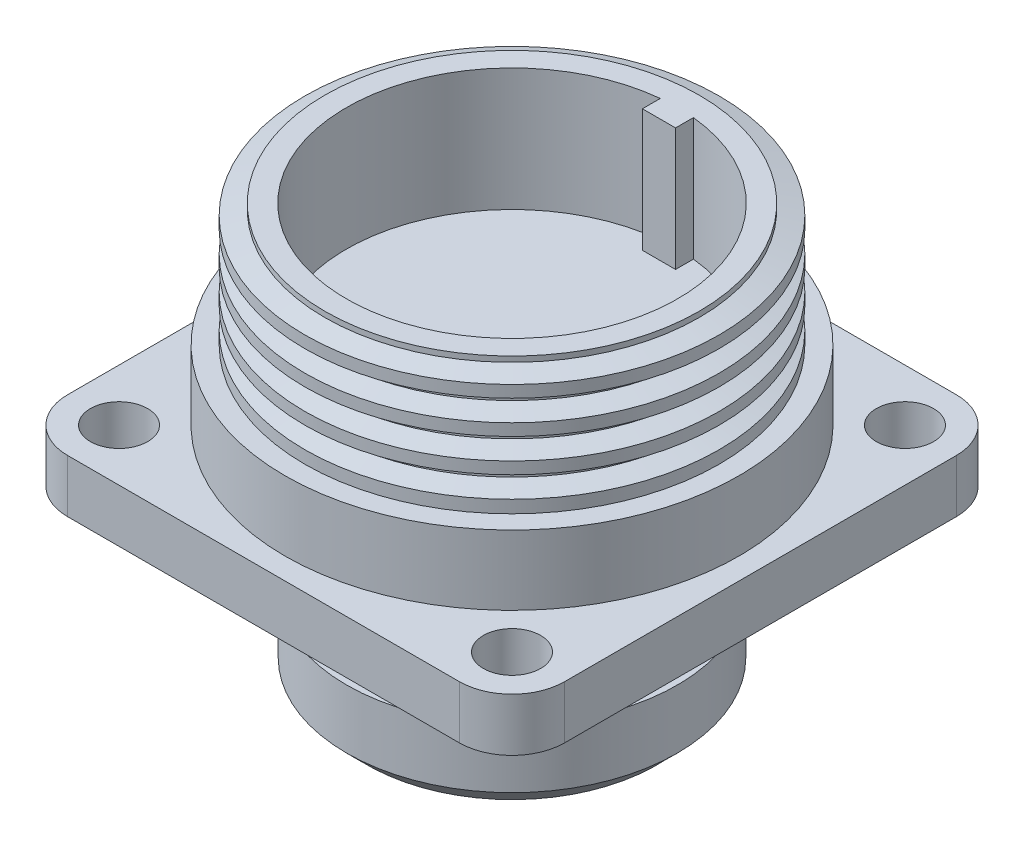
from build123d import *

# Parameters (mm, degrees)
SKETCH1_W           = 38.1
SKETCH1_H           = 38.1
SKETCH1_R           = 2.1971
BASE_EXTRUDE_DEPTH  = 4.064
SKETCH2_R           = 17.399
BOSS_EXTRUDE1_DEPTH = 5.334
SKETCH9_R           = 15.875
EXTRUDE1_DEPTH      = 9.398
SKETCH3_R           = 12.6746
PLUG_DEPTH          = 12.954
CHAMFER1_SIZE       = 1.5748
CUT_EXTRUDE1_DEPTH  = 9.398
FILLET1_R           = 4.0386
SKETCH7_W           = 1.2446
SKETCH7_H           = 2.3622
SKETCH8_W           = 2.5654
SKETCH8_H           = 1.27


with BuildPart() as part:
    # Sketch1 → Base-Extrude (new body)
    with BuildSketch(Plane(origin=(0, 0, 0), x_dir=(1, 0, 0), z_dir=(0, 1, 0))):
        Rectangle(SKETCH1_W, SKETCH1_H)
        with Locations(Location((-15.0622, 15.0622, 0), (0, 0, 270))):
            Circle(SKETCH1_R, mode=Mode.SUBTRACT)
        with Locations(Location((15.0622, 15.0622, 0), (0, 0, 90))):
            Circle(SKETCH1_R, mode=Mode.SUBTRACT)
        with Locations(Location((15.0622, -15.0622, 0), (0, 0, 270))):
            Circle(SKETCH1_R, mode=Mode.SUBTRACT)
        with Locations(Location((-15.0622, -15.0622, 0), (0, 0, 90))):
            Circle(SKETCH1_R, mode=Mode.SUBTRACT)
    extrude(amount=BASE_EXTRUDE_DEPTH)

    # Sketch2 → Boss-Extrude1 (add)
    with BuildSketch(Plane(origin=(0, 4.064, 0), x_dir=(-1, 0, 0), z_dir=(0, 1, 0))):
        with Locations(Location((0, 0, 0), (0, 0, 90))):
            Circle(SKETCH2_R)
    extrude(amount=BOSS_EXTRUDE1_DEPTH)

    # Sketch9 → Extrude1 (add)
    with BuildSketch(Plane(origin=(0, 9.398, 0), x_dir=(1, 0, 0), z_dir=(0, 1, 0))):
        with Locations(Location((0, 0, 0), (0, 0, 270))):
            Circle(SKETCH9_R)
    extrude(amount=EXTRUDE1_DEPTH)

    # Sketch3 → Plug (add)
    with BuildSketch(Plane.XZ):
        with Locations(Location((0, 0, 0), (0, 0, 90))):
            Circle(SKETCH3_R)
    extrude(amount=PLUG_DEPTH)

    # Chamfer1
    chamfer1_edges = [part.edges().sort_by_distance(p)[0] for p in [
        (0, -12.954, -12.6746),
    ]]
    chamfer(chamfer1_edges, length=CHAMFER1_SIZE)

    # Sketch10 → Cut-Extrude1 (cut)
    with BuildSketch(Plane(origin=(0, 18.796, 0), x_dir=(1, 0, 0), z_dir=(0, 1, 0))):
        with BuildLine():
            Line((-1.27, 12.636340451), (-1.27, 11.267947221))
            Line((-1.27, 11.267947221), (1.27, 11.267947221))
            Line((1.27, 11.267947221), (1.27, 12.636340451))
            ThreePointArc((1.27, 12.636340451), (0, -12.7), (-1.27, 12.636340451))
        make_face()
    extrude(amount=-CUT_EXTRUDE1_DEPTH, mode=Mode.SUBTRACT)

    # Fillet1
    fillet1_edges = [part.edges().sort_by_distance(p)[0] for p in [
        (-19.05, 2.032, -19.05),
        (19.05, 2.032, -19.05),
        (19.05, 2.032, 19.05),
        (-19.05, 2.032, 19.05),
    ]]
    fillet(fillet1_edges, radius=FILLET1_R)

    # Sketch7 → Cut-Revolve 2-020 (revolve, cut)
    with BuildSketch(Plane(origin=(0, 0, 0), x_dir=(0, 0, -1), z_dir=(1, 0, 0)), mode=Mode.PRIVATE) as cut_revolve_2_020_sk:
        with Locations((12.0523, -5.6769)):
            Rectangle(SKETCH7_W, SKETCH7_H)
    revolve(cut_revolve_2_020_sk.sketch.rotate(Axis((0, 0, 0), (0, -1, 0)), 180), axis=Axis((0, 0, 0), (0, -1, 0)), mode=Mode.SUBTRACT)

    # Sketch8 → 2-023Cut-Revolve3 (revolve, cut)
    with BuildSketch(Plane(origin=(0, 0, 0), x_dir=(0, 0, -1), z_dir=(1, 0, 0))):
        with Locations((14.6304, 0.635)):
            Rectangle(SKETCH8_W, SKETCH8_H)
    revolve(axis=Axis((0, 0, 0), (0, 1, 0)), mode=Mode.SUBTRACT)

    # Sketch11 → Cut-Revolve1 (revolve, cut)
    with BuildSketch(Plane.XY, mode=Mode.PRIVATE) as cut_revolve1_sk:
        Polygon((14.351, 19.2151), (14.351, 18.3769), (15.875, 17.982766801), (15.875, 17.069233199), (14.351, 16.6751), (14.351, 15.8369), (15.875, 15.442766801), (15.875, 14.529233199), (14.351, 14.1351), (14.351, 13.2969), (15.875, 12.902766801), (15.875, 11.989233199), (14.351, 11.5951), (14.351, 10.7569), (15.875, 10.362766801), (15.875, 9.448366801), (18.683020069, 9.448366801), (18.683020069, 19.609233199), (15.875, 19.609233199), align=None)
    revolve(cut_revolve1_sk.sketch.rotate(Axis((0, 0, 0), (0, 1, 0)), 90), axis=Axis((0, 0, 0), (0, 1, 0)), mode=Mode.SUBTRACT)


solid = part.part
